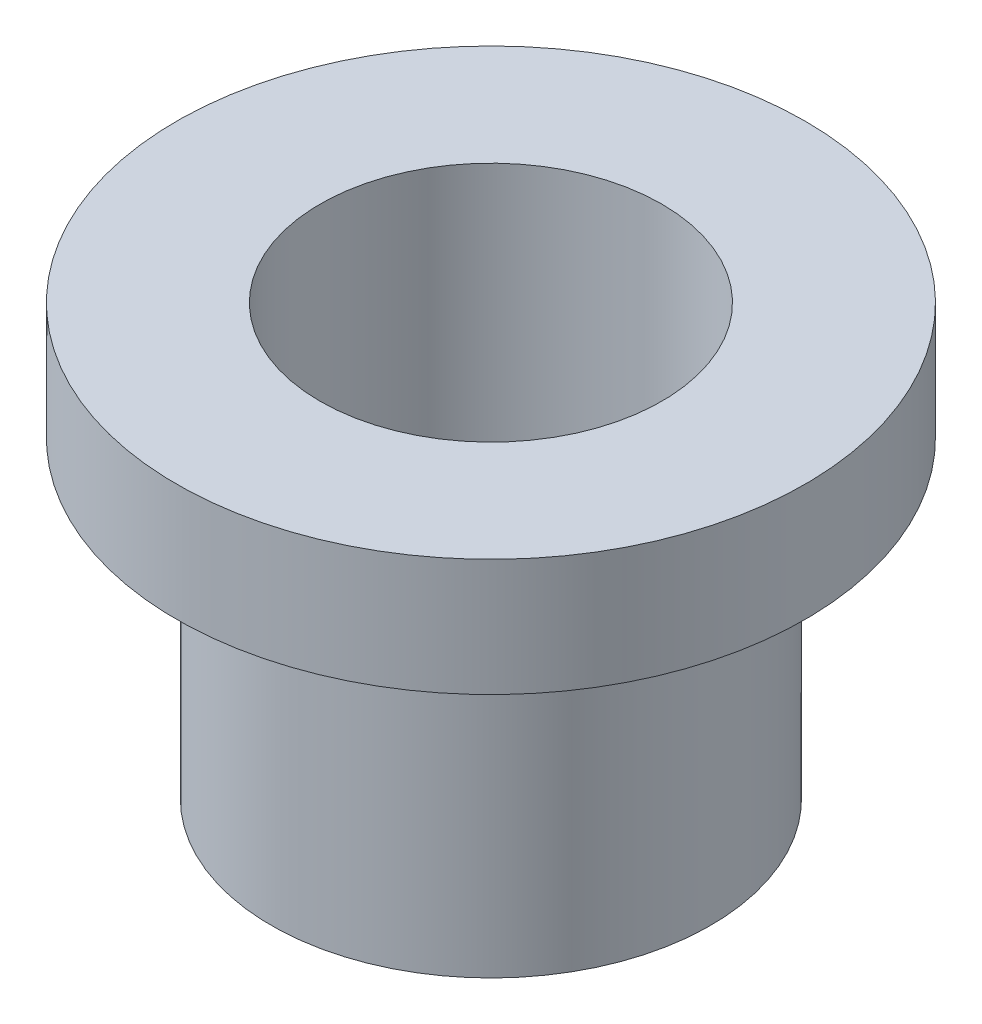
ISO-10303-21;
HEADER;
FILE_DESCRIPTION(('STEP AP214'),'2;1');
FILE_NAME('part.step','',(''),(''),'','','');
FILE_SCHEMA(('AUTOMOTIVE_DESIGN { 1 0 10303 214 1 1 1 1 }'));
ENDSEC;
DATA;
#1=APPLICATION_CONTEXT('core data for automotive mechanical design processes');
#2=APPLICATION_PROTOCOL_DEFINITION('international standard','automotive_design',2000,#1);
#3=PRODUCT_CONTEXT('',#1,'mechanical');
#4=PRODUCT('Part','Part','',(#3));
#5=PRODUCT_RELATED_PRODUCT_CATEGORY('part','',(#4));
#6=PRODUCT_DEFINITION_FORMATION('','',#4);
#7=PRODUCT_DEFINITION_CONTEXT('part definition',#1,'design');
#8=PRODUCT_DEFINITION('design','',#6,#7);
#9=PRODUCT_DEFINITION_SHAPE('','',#8);
#10=(LENGTH_UNIT() NAMED_UNIT(*) SI_UNIT(.MILLI.,.METRE.));
#11=(NAMED_UNIT(*) PLANE_ANGLE_UNIT() SI_UNIT($,.RADIAN.));
#12=(NAMED_UNIT(*) SI_UNIT($,.STERADIAN.) SOLID_ANGLE_UNIT());
#13=UNCERTAINTY_MEASURE_WITH_UNIT(LENGTH_MEASURE(1.E-05),#10,'distance_accuracy_value','');
#14=(GEOMETRIC_REPRESENTATION_CONTEXT(3) GLOBAL_UNCERTAINTY_ASSIGNED_CONTEXT((#13)) GLOBAL_UNIT_ASSIGNED_CONTEXT((#10,
#11,#12)) REPRESENTATION_CONTEXT('',''));
#15=CARTESIAN_POINT('',(0.,0.,0.));
#16=DIRECTION('',(0.,0.,1.));
#17=DIRECTION('',(1.,0.,0.));
#18=AXIS2_PLACEMENT_3D('',#15,#16,#17);
#19=CARTESIAN_POINT('',(0.,0.,0.));
#20=DIRECTION('',(0.,-1.,0.));
#21=DIRECTION('',(0.,0.,-1.));
#22=AXIS2_PLACEMENT_3D('',#19,#20,#21);
#23=CYLINDRICAL_SURFACE('',#22,10.2235);
#24=CARTESIAN_POINT('',(0.,0.,0.));
#25=DIRECTION('',(0.,-1.,0.));
#26=DIRECTION('',(0.,0.,-1.));
#27=AXIS2_PLACEMENT_3D('',#24,#25,#26);
#28=CIRCLE('',#27,10.2235);
#29=CARTESIAN_POINT('',(0.,0.,-10.2235));
#30=VERTEX_POINT('',#29);
#31=EDGE_CURVE('E10',#30,#30,#28,.T.);
#32=ORIENTED_EDGE('',*,*,#31,.F.);
#33=EDGE_LOOP('',(#32));
#34=FACE_BOUND('',#33,.T.);
#35=CARTESIAN_POINT('',(0.,3.81,0.));
#36=DIRECTION('',(0.,-1.,0.));
#37=DIRECTION('',(0.,0.,-1.));
#38=AXIS2_PLACEMENT_3D('',#35,#36,#37);
#39=CIRCLE('',#38,10.2235);
#40=CARTESIAN_POINT('',(0.,3.81,-10.2235));
#41=VERTEX_POINT('',#40);
#42=EDGE_CURVE('E61',#41,#41,#39,.T.);
#43=ORIENTED_EDGE('',*,*,#42,.T.);
#44=EDGE_LOOP('',(#43));
#45=FACE_BOUND('',#44,.T.);
#46=ADVANCED_FACE('F33',(#34,#45),#23,.T.);
#47=CARTESIAN_POINT('',(-10.2235,0.,0.));
#48=DIRECTION('',(0.,1.,0.));
#49=DIRECTION('',(0.,0.,1.));
#50=AXIS2_PLACEMENT_3D('',#47,#48,#49);
#51=PLANE('',#50);
#52=CARTESIAN_POINT('',(0.,0.,0.));
#53=DIRECTION('',(0.,-1.,0.));
#54=DIRECTION('',(0.,0.,-1.));
#55=AXIS2_PLACEMENT_3D('',#52,#53,#54);
#56=CIRCLE('',#55,6.35);
#57=CARTESIAN_POINT('',(0.,0.,-6.35));
#58=VERTEX_POINT('',#57);
#59=EDGE_CURVE('E39',#58,#58,#56,.T.);
#60=ORIENTED_EDGE('',*,*,#59,.F.);
#61=EDGE_LOOP('',(#60));
#62=FACE_BOUND('',#61,.T.);
#63=ORIENTED_EDGE('',*,*,#31,.T.);
#64=EDGE_LOOP('',(#63));
#65=FACE_BOUND('',#64,.T.);
#66=ADVANCED_FACE('F98',(#62,#65),#51,.F.);
#67=CARTESIAN_POINT('',(0.,0.,0.));
#68=DIRECTION('',(0.,-1.,0.));
#69=DIRECTION('',(0.,0.,-1.));
#70=AXIS2_PLACEMENT_3D('',#67,#68,#69);
#71=CYLINDRICAL_SURFACE('',#70,6.35);
#72=CARTESIAN_POINT('',(0.,-2.032,0.));
#73=DIRECTION('',(0.,-1.,0.));
#74=DIRECTION('',(0.,0.,-1.));
#75=AXIS2_PLACEMENT_3D('',#72,#73,#74);
#76=CIRCLE('',#75,6.35);
#77=CARTESIAN_POINT('',(0.,-2.032,-6.35));
#78=VERTEX_POINT('',#77);
#79=EDGE_CURVE('E43',#78,#78,#76,.T.);
#80=ORIENTED_EDGE('',*,*,#79,.F.);
#81=EDGE_LOOP('',(#80));
#82=FACE_BOUND('',#81,.T.);
#83=ORIENTED_EDGE('',*,*,#59,.T.);
#84=EDGE_LOOP('',(#83));
#85=FACE_BOUND('',#84,.T.);
#86=ADVANCED_FACE('F93',(#82,#85),#71,.T.);
#87=CARTESIAN_POINT('',(-6.35,-2.032,0.));
#88=DIRECTION('',(0.,-1.,0.));
#89=DIRECTION('',(0.,0.,-1.));
#90=AXIS2_PLACEMENT_3D('',#87,#88,#89);
#91=PLANE('',#90);
#92=CARTESIAN_POINT('',(0.,-2.032,0.));
#93=DIRECTION('',(0.,-1.,0.));
#94=DIRECTION('',(0.,0.,-1.));
#95=AXIS2_PLACEMENT_3D('',#92,#93,#94);
#96=CIRCLE('',#95,7.14375);
#97=CARTESIAN_POINT('',(0.,-2.032,-7.14375));
#98=VERTEX_POINT('',#97);
#99=EDGE_CURVE('E47',#98,#98,#96,.T.);
#100=ORIENTED_EDGE('',*,*,#99,.F.);
#101=EDGE_LOOP('',(#100));
#102=FACE_BOUND('',#101,.T.);
#103=ORIENTED_EDGE('',*,*,#79,.T.);
#104=EDGE_LOOP('',(#103));
#105=FACE_BOUND('',#104,.T.);
#106=ADVANCED_FACE('F87',(#102,#105),#91,.F.);
#107=CARTESIAN_POINT('',(0.,0.,0.));
#108=DIRECTION('',(0.,-1.,0.));
#109=DIRECTION('',(0.,0.,-1.));
#110=AXIS2_PLACEMENT_3D('',#107,#108,#109);
#111=CYLINDRICAL_SURFACE('',#110,7.14375);
#112=CARTESIAN_POINT('',(0.,-10.16,0.));
#113=DIRECTION('',(0.,-1.,0.));
#114=DIRECTION('',(0.,0.,-1.));
#115=AXIS2_PLACEMENT_3D('',#112,#113,#114);
#116=CIRCLE('',#115,7.14375);
#117=CARTESIAN_POINT('',(0.,-10.16,-7.14375));
#118=VERTEX_POINT('',#117);
#119=EDGE_CURVE('E52',#118,#118,#116,.T.);
#120=ORIENTED_EDGE('',*,*,#119,.F.);
#121=EDGE_LOOP('',(#120));
#122=FACE_BOUND('',#121,.T.);
#123=ORIENTED_EDGE('',*,*,#99,.T.);
#124=EDGE_LOOP('',(#123));
#125=FACE_BOUND('',#124,.T.);
#126=ADVANCED_FACE('F81',(#122,#125),#111,.T.);
#127=CARTESIAN_POINT('',(-7.14375,-10.16,0.));
#128=DIRECTION('',(0.,1.,0.));
#129=DIRECTION('',(0.,0.,1.));
#130=AXIS2_PLACEMENT_3D('',#127,#128,#129);
#131=PLANE('',#130);
#132=CARTESIAN_POINT('',(0.,-10.16,0.));
#133=DIRECTION('',(0.,-1.,0.));
#134=DIRECTION('',(0.,0.,-1.));
#135=AXIS2_PLACEMENT_3D('',#132,#133,#134);
#136=CIRCLE('',#135,5.55625);
#137=CARTESIAN_POINT('',(0.,-10.16,-5.55625));
#138=VERTEX_POINT('',#137);
#139=EDGE_CURVE('E55',#138,#138,#136,.T.);
#140=ORIENTED_EDGE('',*,*,#139,.F.);
#141=EDGE_LOOP('',(#140));
#142=FACE_BOUND('',#141,.T.);
#143=ORIENTED_EDGE('',*,*,#119,.T.);
#144=EDGE_LOOP('',(#143));
#145=FACE_BOUND('',#144,.T.);
#146=ADVANCED_FACE('F75',(#142,#145),#131,.F.);
#147=CARTESIAN_POINT('',(0.,0.,0.));
#148=DIRECTION('',(0.,-1.,0.));
#149=DIRECTION('',(0.,0.,-1.));
#150=AXIS2_PLACEMENT_3D('',#147,#148,#149);
#151=CYLINDRICAL_SURFACE('',#150,5.55625);
#152=CARTESIAN_POINT('',(0.,3.81,0.));
#153=DIRECTION('',(0.,-1.,0.));
#154=DIRECTION('',(0.,0.,-1.));
#155=AXIS2_PLACEMENT_3D('',#152,#153,#154);
#156=CIRCLE('',#155,5.55625);
#157=CARTESIAN_POINT('',(0.,3.81,-5.55625));
#158=VERTEX_POINT('',#157);
#159=EDGE_CURVE('E58',#158,#158,#156,.T.);
#160=ORIENTED_EDGE('',*,*,#159,.F.);
#161=EDGE_LOOP('',(#160));
#162=FACE_BOUND('',#161,.T.);
#163=ORIENTED_EDGE('',*,*,#139,.T.);
#164=EDGE_LOOP('',(#163));
#165=FACE_BOUND('',#164,.T.);
#166=ADVANCED_FACE('F69',(#162,#165),#151,.F.);
#167=CARTESIAN_POINT('',(-5.55625,3.81,0.));
#168=DIRECTION('',(0.,-1.,0.));
#169=DIRECTION('',(0.,0.,-1.));
#170=AXIS2_PLACEMENT_3D('',#167,#168,#169);
#171=PLANE('',#170);
#172=ORIENTED_EDGE('',*,*,#42,.F.);
#173=EDGE_LOOP('',(#172));
#174=FACE_BOUND('',#173,.T.);
#175=ORIENTED_EDGE('',*,*,#159,.T.);
#176=EDGE_LOOP('',(#175));
#177=FACE_BOUND('',#176,.T.);
#178=ADVANCED_FACE('F66',(#174,#177),#171,.F.);
#179=CLOSED_SHELL('',(#46,#66,#86,#106,#126,#146,#166,#178));
#180=MANIFOLD_SOLID_BREP('B2',#179);
#181=ADVANCED_BREP_SHAPE_REPRESENTATION('',(#18,#180),#14);
#182=SHAPE_DEFINITION_REPRESENTATION(#9,#181);
ENDSEC;
END-ISO-10303-21;
